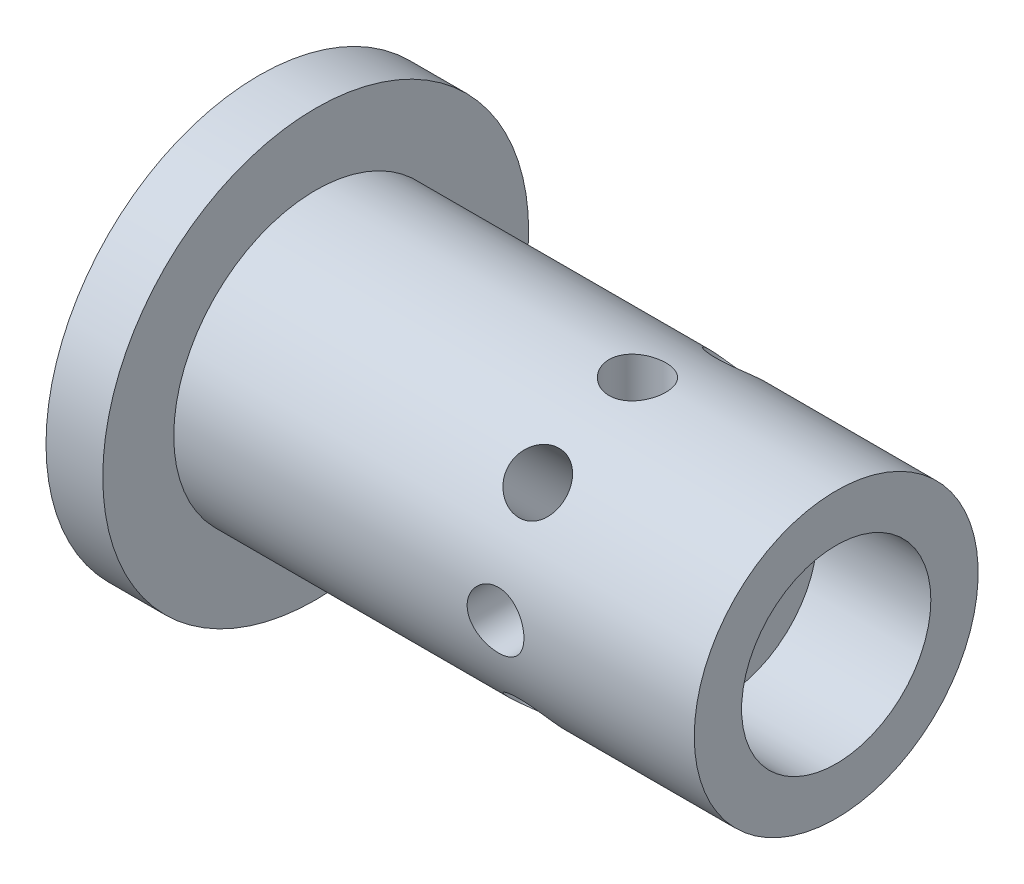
from build123d import *

# Parameters (mm, degrees)
ESQUISSE2_R                  = 10
ENL_V_MAT_EXTRU_1_DEPTH      = 12
ENL_V_MAT_EXTRU_3_REACH      = 70.8
ENL_V_MAT_EXTRU_3_END_RADIUS = 15
ESQUISSE4_R                  = 3
R_P_TITION_CIRCULAIRE1_COUNT = 8
ESQUISSE6_R                  = 6
ENL_V_MAT_EXTRU_5_DEPTH      = 49


with BuildPart() as part:
    # Esquisse1 → R_volution1 (revolve)
    with BuildSketch(Plane.XY, mode=Mode.PRIVATE) as r_volution1_sk:
        Polygon((0, 0), (0, 22.5), (6, 22.5), (6, 15), (61, 15), (61, 0), align=None)
    revolve(r_volution1_sk.sketch.rotate(Axis((-15.805496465, 0, 0), (1, 0, 0)), 90), axis=Axis((-15.805496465, 0, 0), (1, 0, 0)))

    # Esquisse2 → Enl_v. mat.-Extru.1 (cut)
    with BuildSketch(Plane(origin=(61, 0, 0), x_dir=(0, 0, -1), z_dir=(1, 0, 0))):
        Circle(ESQUISSE2_R)
    extrude(amount=-ENL_V_MAT_EXTRU_1_DEPTH, mode=Mode.SUBTRACT)

    # Enl_v. mat.-Extru.3: up to this cylinder (the profile starts inside it)
    enl_v_mat_extru_3_end = Plane(origin=(40, 0, 0), z_dir=(-1, 0, 0)) * Cylinder(ENL_V_MAT_EXTRU_3_END_RADIUS, 172.6, mode=Mode.PRIVATE)
    # Esquisse4 → Enl_v. mat.-Extru.3 (cut, up to the surface)
    with BuildSketch(Plane.XY, mode=Mode.PRIVATE) as enl_v_mat_extru_3_sk1:
        with Locations((40, 0)):
            Circle(ESQUISSE4_R)
    enl_v_mat_extru_3_tool1 = extrude(enl_v_mat_extru_3_sk1.sketch, amount=-ENL_V_MAT_EXTRU_3_REACH, mode=Mode.PRIVATE) & enl_v_mat_extru_3_end
    enl_v_mat_extru_3 = enl_v_mat_extru_3_tool1.solids().sort_by_distance((40, 0, 0))[0]
    add(enl_v_mat_extru_3, mode=Mode.SUBTRACT)

    # R_p_tition circulaire1: Enl_v. mat.-Extru.3 ×8 about axis
    r_p_tition_circulaire1_axis = Axis((49, 0, 0), (1, 0, 0))
    for i in range(1, R_P_TITION_CIRCULAIRE1_COUNT):
        add(enl_v_mat_extru_3.rotate(r_p_tition_circulaire1_axis, i * 360 / R_P_TITION_CIRCULAIRE1_COUNT), mode=Mode.SUBTRACT)

    # Esquisse6 → Enl_v. mat.-Extru.5 (cut)
    with BuildSketch(Plane.ZY):
        Circle(ESQUISSE6_R)
    extrude(amount=-ENL_V_MAT_EXTRU_5_DEPTH, mode=Mode.SUBTRACT)


solid = part.part
